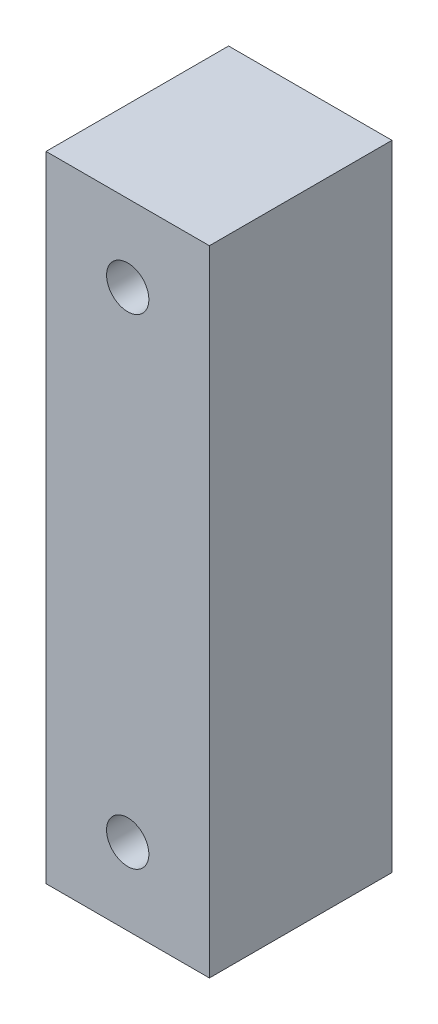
ISO-10303-21;
HEADER;
FILE_DESCRIPTION(('STEP AP214'),'2;1');
FILE_NAME('part.step','',(''),(''),'','','');
FILE_SCHEMA(('AUTOMOTIVE_DESIGN { 1 0 10303 214 1 1 1 1 }'));
ENDSEC;
DATA;
#1=APPLICATION_CONTEXT('core data for automotive mechanical design processes');
#2=APPLICATION_PROTOCOL_DEFINITION('international standard','automotive_design',2000,#1);
#3=PRODUCT_CONTEXT('',#1,'mechanical');
#4=PRODUCT('Part','Part','',(#3));
#5=PRODUCT_RELATED_PRODUCT_CATEGORY('part','',(#4));
#6=PRODUCT_DEFINITION_FORMATION('','',#4);
#7=PRODUCT_DEFINITION_CONTEXT('part definition',#1,'design');
#8=PRODUCT_DEFINITION('design','',#6,#7);
#9=PRODUCT_DEFINITION_SHAPE('','',#8);
#10=(LENGTH_UNIT() NAMED_UNIT(*) SI_UNIT(.MILLI.,.METRE.));
#11=(NAMED_UNIT(*) PLANE_ANGLE_UNIT() SI_UNIT($,.RADIAN.));
#12=(NAMED_UNIT(*) SI_UNIT($,.STERADIAN.) SOLID_ANGLE_UNIT());
#13=UNCERTAINTY_MEASURE_WITH_UNIT(LENGTH_MEASURE(1.E-05),#10,'distance_accuracy_value','');
#14=(GEOMETRIC_REPRESENTATION_CONTEXT(3) GLOBAL_UNCERTAINTY_ASSIGNED_CONTEXT((#13)) GLOBAL_UNIT_ASSIGNED_CONTEXT((#10,
#11,#12)) REPRESENTATION_CONTEXT('',''));
#15=CARTESIAN_POINT('',(0.,0.,0.));
#16=DIRECTION('',(0.,0.,1.));
#17=DIRECTION('',(1.,0.,0.));
#18=AXIS2_PLACEMENT_3D('',#15,#16,#17);
#19=CARTESIAN_POINT('',(85.,165.,-83.5));
#20=DIRECTION('',(0.,-1.,0.));
#21=DIRECTION('',(0.,0.,-1.));
#22=AXIS2_PLACEMENT_3D('',#19,#20,#21);
#23=PLANE('',#22);
#24=DIRECTION('',(0.,0.,1.));
#25=VECTOR('',#24,1.);
#26=CARTESIAN_POINT('',(0.,165.,-83.5));
#27=LINE('',#26,#25);
#28=CARTESIAN_POINT('',(0.,165.,-83.5));
#29=VERTEX_POINT('',#28);
#30=CARTESIAN_POINT('',(0.,165.,11.5));
#31=VERTEX_POINT('',#30);
#32=EDGE_CURVE('E117',#29,#31,#27,.T.);
#33=ORIENTED_EDGE('',*,*,#32,.T.);
#34=DIRECTION('',(-1.,0.,0.));
#35=VECTOR('',#34,1.);
#36=CARTESIAN_POINT('',(85.,165.,11.5));
#37=LINE('',#36,#35);
#38=CARTESIAN_POINT('',(85.,165.,11.5));
#39=VERTEX_POINT('',#38);
#40=EDGE_CURVE('E11',#39,#31,#37,.T.);
#41=ORIENTED_EDGE('',*,*,#40,.F.);
#42=DIRECTION('',(0.,0.,1.));
#43=VECTOR('',#42,1.);
#44=CARTESIAN_POINT('',(85.,165.,-83.5));
#45=LINE('',#44,#43);
#46=CARTESIAN_POINT('',(85.,165.,-83.5));
#47=VERTEX_POINT('',#46);
#48=EDGE_CURVE('E103',#47,#39,#45,.T.);
#49=ORIENTED_EDGE('',*,*,#48,.F.);
#50=DIRECTION('',(-1.,0.,0.));
#51=VECTOR('',#50,1.);
#52=CARTESIAN_POINT('',(85.,165.,-83.5));
#53=LINE('',#52,#51);
#54=EDGE_CURVE('E113',#47,#29,#53,.T.);
#55=ORIENTED_EDGE('',*,*,#54,.T.);
#56=EDGE_LOOP('',(#33,#41,#49,#55));
#57=FACE_BOUND('',#56,.T.);
#58=ADVANCED_FACE('F47',(#57),#23,.F.);
#59=CARTESIAN_POINT('',(85.,-165.,11.5));
#60=DIRECTION('',(0.,0.,-1.));
#61=DIRECTION('',(-1.,0.,0.));
#62=AXIS2_PLACEMENT_3D('',#59,#60,#61);
#63=PLANE('',#62);
#64=CARTESIAN_POINT('',(42.5,125.,11.5));
#65=DIRECTION('',(0.,0.,1.));
#66=DIRECTION('',(1.,0.,0.));
#67=AXIS2_PLACEMENT_3D('',#64,#65,#66);
#68=CIRCLE('',#67,11.);
#69=CARTESIAN_POINT('',(53.5,125.,11.5));
#70=VERTEX_POINT('',#69);
#71=EDGE_CURVE('E130',#70,#70,#68,.T.);
#72=ORIENTED_EDGE('',*,*,#71,.F.);
#73=EDGE_LOOP('',(#72));
#74=FACE_BOUND('',#73,.T.);
#75=CARTESIAN_POINT('',(42.5,-125.,11.5));
#76=DIRECTION('',(0.,0.,1.));
#77=DIRECTION('',(-1.,0.,0.));
#78=AXIS2_PLACEMENT_3D('',#75,#76,#77);
#79=CIRCLE('',#78,11.);
#80=CARTESIAN_POINT('',(31.5,-125.,11.5));
#81=VERTEX_POINT('',#80);
#82=EDGE_CURVE('E137',#81,#81,#79,.T.);
#83=ORIENTED_EDGE('',*,*,#82,.F.);
#84=EDGE_LOOP('',(#83));
#85=FACE_BOUND('',#84,.T.);
#86=DIRECTION('',(0.,-1.,0.));
#87=VECTOR('',#86,1.);
#88=CARTESIAN_POINT('',(0.,-165.,11.5));
#89=LINE('',#88,#87);
#90=CARTESIAN_POINT('',(0.,-165.,11.5));
#91=VERTEX_POINT('',#90);
#92=EDGE_CURVE('E108',#31,#91,#89,.T.);
#93=ORIENTED_EDGE('',*,*,#92,.T.);
#94=DIRECTION('',(-1.,0.,0.));
#95=VECTOR('',#94,1.);
#96=CARTESIAN_POINT('',(85.,-165.,11.5));
#97=LINE('',#96,#95);
#98=CARTESIAN_POINT('',(85.,-165.,11.5));
#99=VERTEX_POINT('',#98);
#100=EDGE_CURVE('E57',#99,#91,#97,.T.);
#101=ORIENTED_EDGE('',*,*,#100,.F.);
#102=DIRECTION('',(0.,-1.,0.));
#103=VECTOR('',#102,1.);
#104=CARTESIAN_POINT('',(85.,-165.,11.5));
#105=LINE('',#104,#103);
#106=EDGE_CURVE('E98',#39,#99,#105,.T.);
#107=ORIENTED_EDGE('',*,*,#106,.F.);
#108=ORIENTED_EDGE('',*,*,#40,.T.);
#109=EDGE_LOOP('',(#93,#101,#107,#108));
#110=FACE_BOUND('',#109,.T.);
#111=ADVANCED_FACE('F107',(#74,#85,#110),#63,.F.);
#112=CARTESIAN_POINT('',(85.,-165.,-83.4999999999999));
#113=DIRECTION('',(0.,1.,0.));
#114=DIRECTION('',(0.,0.,1.));
#115=AXIS2_PLACEMENT_3D('',#112,#113,#114);
#116=PLANE('',#115);
#117=DIRECTION('',(0.,0.,-1.));
#118=VECTOR('',#117,1.);
#119=CARTESIAN_POINT('',(0.,-165.,-83.4999999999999));
#120=LINE('',#119,#118);
#121=CARTESIAN_POINT('',(0.,-165.,-83.4999999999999));
#122=VERTEX_POINT('',#121);
#123=EDGE_CURVE('E84',#91,#122,#120,.T.);
#124=ORIENTED_EDGE('',*,*,#123,.T.);
#125=DIRECTION('',(-1.,0.,0.));
#126=VECTOR('',#125,1.);
#127=CARTESIAN_POINT('',(85.,-165.,-83.4999999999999));
#128=LINE('',#127,#126);
#129=CARTESIAN_POINT('',(85.,-165.,-83.4999999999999));
#130=VERTEX_POINT('',#129);
#131=EDGE_CURVE('E109',#130,#122,#128,.T.);
#132=ORIENTED_EDGE('',*,*,#131,.F.);
#133=DIRECTION('',(0.,0.,-1.));
#134=VECTOR('',#133,1.);
#135=CARTESIAN_POINT('',(85.,-165.,-83.4999999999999));
#136=LINE('',#135,#134);
#137=EDGE_CURVE('E101',#99,#130,#136,.T.);
#138=ORIENTED_EDGE('',*,*,#137,.F.);
#139=ORIENTED_EDGE('',*,*,#100,.T.);
#140=EDGE_LOOP('',(#124,#132,#138,#139));
#141=FACE_BOUND('',#140,.T.);
#142=ADVANCED_FACE('F111',(#141),#116,.F.);
#143=CARTESIAN_POINT('',(85.,-165.,-83.4999999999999));
#144=DIRECTION('',(0.,0.,1.));
#145=DIRECTION('',(0.,-1.,0.));
#146=AXIS2_PLACEMENT_3D('',#143,#144,#145);
#147=PLANE('',#146);
#148=CARTESIAN_POINT('',(42.5,125.,-83.5));
#149=DIRECTION('',(0.,0.,1.));
#150=DIRECTION('',(0.,-1.,0.));
#151=AXIS2_PLACEMENT_3D('',#148,#149,#150);
#152=CIRCLE('',#151,11.);
#153=CARTESIAN_POINT('',(42.5,114.,-83.5));
#154=VERTEX_POINT('',#153);
#155=EDGE_CURVE('E50',#154,#154,#152,.T.);
#156=ORIENTED_EDGE('',*,*,#155,.T.);
#157=EDGE_LOOP('',(#156));
#158=FACE_BOUND('',#157,.T.);
#159=CARTESIAN_POINT('',(42.5,-125.,-83.5));
#160=DIRECTION('',(0.,0.,1.));
#161=DIRECTION('',(0.,-1.,0.));
#162=AXIS2_PLACEMENT_3D('',#159,#160,#161);
#163=CIRCLE('',#162,11.);
#164=CARTESIAN_POINT('',(42.5,-136.,-83.5));
#165=VERTEX_POINT('',#164);
#166=EDGE_CURVE('E128',#165,#165,#163,.T.);
#167=ORIENTED_EDGE('',*,*,#166,.T.);
#168=EDGE_LOOP('',(#167));
#169=FACE_BOUND('',#168,.T.);
#170=DIRECTION('',(0.,1.,0.));
#171=VECTOR('',#170,1.);
#172=CARTESIAN_POINT('',(0.,-165.,-83.4999999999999));
#173=LINE('',#172,#171);
#174=EDGE_CURVE('E91',#122,#29,#173,.T.);
#175=ORIENTED_EDGE('',*,*,#174,.T.);
#176=ORIENTED_EDGE('',*,*,#54,.F.);
#177=DIRECTION('',(0.,1.,0.));
#178=VECTOR('',#177,1.);
#179=CARTESIAN_POINT('',(85.,-165.,-83.4999999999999));
#180=LINE('',#179,#178);
#181=EDGE_CURVE('E66',#130,#47,#180,.T.);
#182=ORIENTED_EDGE('',*,*,#181,.F.);
#183=ORIENTED_EDGE('',*,*,#131,.T.);
#184=EDGE_LOOP('',(#175,#176,#182,#183));
#185=FACE_BOUND('',#184,.T.);
#186=ADVANCED_FACE('F153',(#158,#169,#185),#147,.F.);
#187=CARTESIAN_POINT('',(85.,0.,0.));
#188=DIRECTION('',(-1.,0.,0.));
#189=DIRECTION('',(0.,0.,1.));
#190=AXIS2_PLACEMENT_3D('',#187,#188,#189);
#191=PLANE('',#190);
#192=ORIENTED_EDGE('',*,*,#48,.T.);
#193=ORIENTED_EDGE('',*,*,#106,.T.);
#194=ORIENTED_EDGE('',*,*,#137,.T.);
#195=ORIENTED_EDGE('',*,*,#181,.T.);
#196=EDGE_LOOP('',(#192,#193,#194,#195));
#197=FACE_BOUND('',#196,.T.);
#198=ADVANCED_FACE('F99',(#197),#191,.F.);
#199=CARTESIAN_POINT('',(0.,0.,0.));
#200=DIRECTION('',(-1.,0.,0.));
#201=DIRECTION('',(0.,0.,1.));
#202=AXIS2_PLACEMENT_3D('',#199,#200,#201);
#203=PLANE('',#202);
#204=ORIENTED_EDGE('',*,*,#32,.F.);
#205=ORIENTED_EDGE('',*,*,#174,.F.);
#206=ORIENTED_EDGE('',*,*,#123,.F.);
#207=ORIENTED_EDGE('',*,*,#92,.F.);
#208=EDGE_LOOP('',(#204,#205,#206,#207));
#209=FACE_BOUND('',#208,.T.);
#210=ADVANCED_FACE('F161',(#209),#203,.T.);
#211=CARTESIAN_POINT('',(42.5,-125.,-138.5));
#212=DIRECTION('',(0.,0.,1.));
#213=DIRECTION('',(1.,0.,0.));
#214=AXIS2_PLACEMENT_3D('',#211,#212,#213);
#215=CYLINDRICAL_SURFACE('',#214,11.);
#216=ORIENTED_EDGE('',*,*,#82,.T.);
#217=EDGE_LOOP('',(#216));
#218=FACE_BOUND('',#217,.T.);
#219=ORIENTED_EDGE('',*,*,#166,.F.);
#220=EDGE_LOOP('',(#219));
#221=FACE_BOUND('',#220,.T.);
#222=ADVANCED_FACE('F145',(#218,#221),#215,.F.);
#223=CARTESIAN_POINT('',(42.5,125.,-138.5));
#224=DIRECTION('',(0.,0.,1.));
#225=DIRECTION('',(1.,0.,0.));
#226=AXIS2_PLACEMENT_3D('',#223,#224,#225);
#227=CYLINDRICAL_SURFACE('',#226,11.);
#228=ORIENTED_EDGE('',*,*,#71,.T.);
#229=EDGE_LOOP('',(#228));
#230=FACE_BOUND('',#229,.T.);
#231=ORIENTED_EDGE('',*,*,#155,.F.);
#232=EDGE_LOOP('',(#231));
#233=FACE_BOUND('',#232,.T.);
#234=ADVANCED_FACE('F168',(#230,#233),#227,.F.);
#235=CLOSED_SHELL('',(#58,#111,#142,#186,#198,#210,#222,#234));
#236=MANIFOLD_SOLID_BREP('B2',#235);
#237=ADVANCED_BREP_SHAPE_REPRESENTATION('',(#18,#236),#14);
#238=SHAPE_DEFINITION_REPRESENTATION(#9,#237);
ENDSEC;
END-ISO-10303-21;
